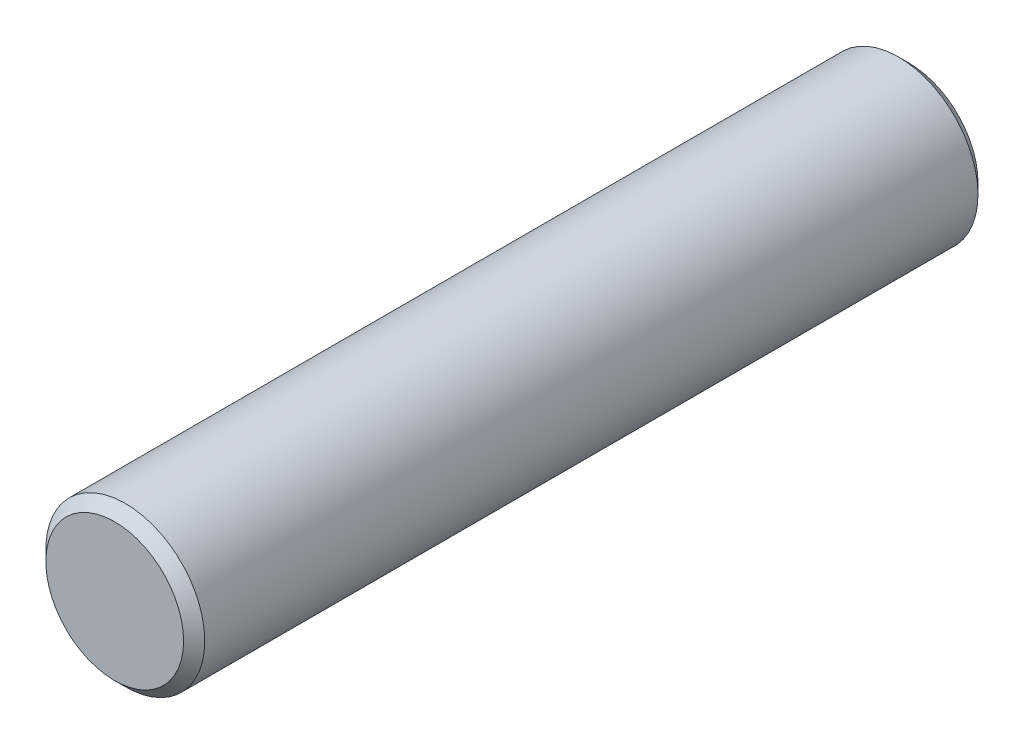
from build123d import *

# Parameters (mm, degrees)
ESQUISSE1_R          = 7.5
BASE_EXTRUSION_DEPTH = 75
CHANFREIN1_SIZE      = 1


with BuildPart() as part:
    # Esquisse1 → Base-Extrusion (new body)
    with BuildSketch(Plane.XY):
        Circle(ESQUISSE1_R)
    extrude(amount=BASE_EXTRUSION_DEPTH)

    # Chanfrein1
    chanfrein1_edges = [part.edges().sort_by_distance(p)[0] for p in [
        (-7.5, 0, 0),
        (-7.5, 0, 75),
    ]]
    chamfer(chanfrein1_edges, length=CHANFREIN1_SIZE)


solid = part.part
